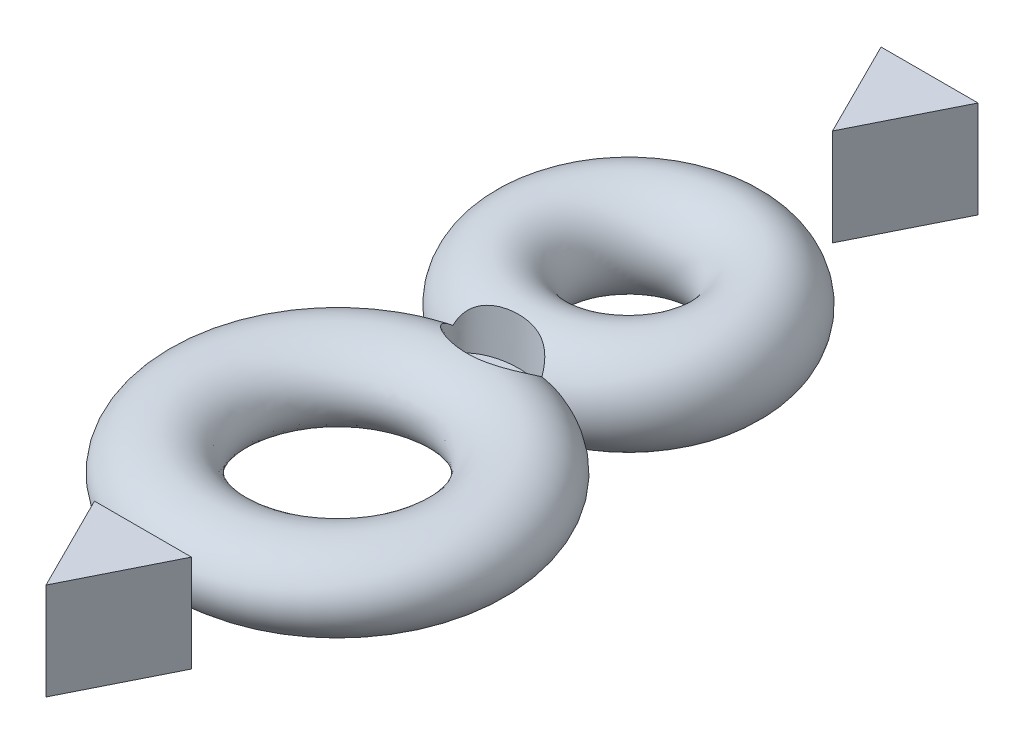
from build123d import *

# Parameters (mm, degrees)
SKETCH3_RX            = 7.5
SKETCH3_RY            = 6
SKETCH4_R             = 7.5
SKETCH7_RX            = 7
SKETCH7_RY            = 4
CUT_EXTRUDE1_DEPTH    = 10
BOSS_EXTRUDE3_DEPTH   = 7.5
BOSS_EXTRUDE3_2_DEPTH = 7.5


with BuildPart() as part:
    # Sketch3 → Revolve4 (revolve)
    with BuildSketch(Plane(origin=(0, 0, 0), x_dir=(0, 0, -1), z_dir=(1, 0, 0))):
        with Locations(Location((-10, 0), (0, 0, 180))):
            Ellipse(SKETCH3_RX, SKETCH3_RY)
    revolve(axis=Axis((0, 0, 30), (0, 1, 0)))

    # Sketch4 → Revolve5 (revolve)
    with BuildSketch(Plane(origin=(0, 0, 0), x_dir=(0, 0, -1), z_dir=(1, 0, 0)), mode=Mode.PRIVATE) as revolve5_sk:
        Circle(SKETCH4_R)
    revolve(revolve5_sk.sketch.rotate(Axis((0, 0, -15), (0, 1, 0)), 104.385926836), axis=Axis((0, 0, -15), (0, 1, 0)))

    # Sketch7 → Cut-Extrude1 (cut)
    with BuildSketch(Plane(origin=(0, 0, 0), x_dir=(1, 0, 0), z_dir=(0, 1, 0))):
        with Locations((0, -6)):
            Ellipse(SKETCH7_RX, SKETCH7_RY)
    extrude(amount=CUT_EXTRUDE1_DEPTH, mode=Mode.SUBTRACT)


with BuildPart() as body_2:
    # Sketch8 → Boss-Extrude3 (new, symmetric)
    with BuildSketch(Plane(origin=(0, 0, 0), x_dir=(1, 0, 0), z_dir=(0, 1, 0))):
        Polygon((-7.5, 61.576987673), (0, 46.576987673), (7.5, 61.576987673), align=None)
    extrude(amount=BOSS_EXTRUDE3_DEPTH, both=True)


with BuildPart() as body_3:
    # Sketch8 → Boss-Extrude3 2 (new, symmetric)
    with BuildSketch(Plane(origin=(0, 0, 0), x_dir=(1, 0, 0), z_dir=(0, 1, 0))):
        Polygon((-7.5, -60.097920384), (7.5, -60.097920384), (0, -75.097920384), align=None)
    extrude(amount=BOSS_EXTRUDE3_2_DEPTH, both=True)


solid = Compound([part.part, body_2.part, body_3.part])
